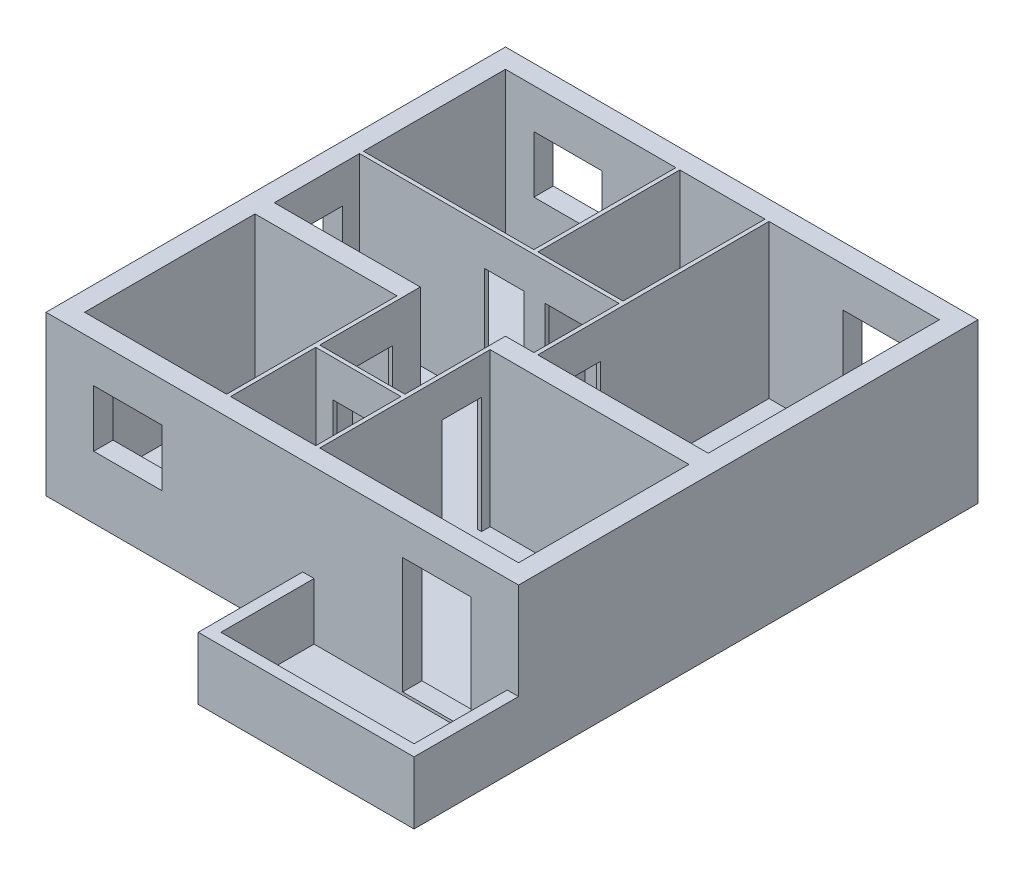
from build123d import *

# Parameters (mm, degrees)
ESQUISSE1_W              = 8320
ESQUISSE1_H              = 8090
ESQUISSE1_W_2            = 2500
ESQUISSE1_H_2            = 3000
ESQUISSE1_W_3            = 1500
ESQUISSE1_H_3            = 1500
ESQUISSE1_W_4            = 3500
ESQUISSE1_W_5            = 3000
ESQUISSE1_H_4            = 4070
ESQUISSE1_H_5            = 2500
BOSS_EXTRU_1_DEPTH       = 2700
BOSS_EXTRU_2_DEPTH       = 100
BOSS_EXTRU_3_DEPTH       = 1000
ESQUISSE4_W              = 900
ESQUISSE4_H              = 2050
ENL_V_MAT_EXTRU_1_DEPTH  = 1000
ESQUISSE5_W              = 700
ESQUISSE5_H              = 2050
ENL_V_MAT_EXTRU_2_DEPTH  = 1000
ESQUISSE6_W              = 700
ESQUISSE6_H              = 2050
ENL_V_MAT_EXTRU_3_DEPTH  = 1921
ESQUISSE7_W              = 700
ESQUISSE7_H              = 2050
ENL_V_MAT_EXTRU_4_DEPTH  = 1921
ESQUISSE8_W              = 700
ESQUISSE8_H              = 2050
ENL_V_MAT_EXTRU_5_DEPTH  = 1412
ESQUISSE9_W              = 700
ESQUISSE9_H              = 2050
ENL_V_MAT_EXTRU_6_DEPTH  = 1412
ESQUISSE10_W             = 1200
ESQUISSE10_H             = 2050
ENL_V_MAT_EXTRU_7_DEPTH  = 668
ESQUISSE11_W             = 1200
ESQUISSE11_H             = 1000
ENL_V_MAT_EXTRU_8_DEPTH  = 668
ESQUISSE12_W             = 1200
ESQUISSE12_H             = 1000
ENL_V_MAT_EXTRU_9_DEPTH  = 668
ESQUISSE13_W             = 1200
ESQUISSE13_H             = 1000
ENL_V_MAT_EXTRU_10_DEPTH = 668


with BuildPart() as part:
    # Esquisse1 → Boss.-Extru.1 (new body)
    with BuildSketch(Plane.XZ):
        with Locations((1320, -705)):
            Rectangle(ESQUISSE1_W, ESQUISSE1_H)
        Polygon((-2500, -340), (-2500, -1840), (2070, -1840), (2070, -340), (1570, -340), (1570, 1430), (70, 1430), (70, -340), align=None, mode=Mode.SUBTRACT)
        with Locations((-1250, 1500)):
            Rectangle(ESQUISSE1_W_2, ESQUISSE1_H_2, mode=Mode.SUBTRACT)
        with Locations((820, 2250)):
            Rectangle(ESQUISSE1_W_3, ESQUISSE1_H_3, mode=Mode.SUBTRACT)
        with Locations((3390, 1500)):
            Rectangle(ESQUISSE1_W_4, ESQUISSE1_H_2, mode=Mode.SUBTRACT)
        with Locations((3640, -2375)):
            Rectangle(ESQUISSE1_W_5, ESQUISSE1_H_4, mode=Mode.SUBTRACT)
        with Locations((1320, -3160)):
            Rectangle(ESQUISSE1_W_3, ESQUISSE1_H_5, mode=Mode.SUBTRACT)
        with Locations((-1000, -3160)):
            Rectangle(ESQUISSE1_W_5, ESQUISSE1_H_5, mode=Mode.SUBTRACT)
    extrude(amount=BOSS_EXTRU_1_DEPTH)

    # Esquisse2 → Boss.-Extru.2 (add)
    with BuildSketch(Plane.XZ.offset(2700)):
        Polygon((5480, -4750), (-2840, -4750), (-2840, 3340), (1680, 3340), (1680, 5180), (5480, 5180), (5480, 3340), align=None)
    extrude(amount=BOSS_EXTRU_2_DEPTH)

    # Esquisse3 → Boss.-Extru.3 (add)
    with BuildSketch(Plane(origin=(0, -2700, 0), x_dir=(1, 0, 0), z_dir=(0, 1, 0))):
        Polygon((5480, -5180), (5048.043845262, -5180), (1680, -5180), (1680, -3340), (1880, -3340), (1880, -4980), (5280, -4980), (5280, -3340), (5480, -3340), align=None)
    extrude(amount=BOSS_EXTRU_3_DEPTH)

    # Esquisse4 → Enl_v. mat.-Extru.1 (cut)
    with BuildSketch(Plane(origin=(-2500, 0, 0), x_dir=(0, 0, -1), z_dir=(1, 0, 0))):
        with Locations((1090, -1675)):
            Rectangle(ESQUISSE4_W, ESQUISSE4_H)
    extrude(amount=-ENL_V_MAT_EXTRU_1_DEPTH, mode=Mode.SUBTRACT)

    # Esquisse5 → Enl_v. mat.-Extru.2 (cut)
    with BuildSketch(Plane(origin=(0, 0, 1430), x_dir=(-1, 0, 0), z_dir=(0, 0, -1))):
        with Locations((-720, -1675)):
            Rectangle(ESQUISSE5_W, ESQUISSE5_H)
    extrude(amount=-ENL_V_MAT_EXTRU_2_DEPTH, mode=Mode.SUBTRACT)

    # Esquisse6 → Enl_v. mat.-Extru.3 (cut)
    with BuildSketch(Plane(origin=(1640, 0, 0), x_dir=(0, 0, -1), z_dir=(1, 0, 0))):
        with Locations((-500, -1675)):
            Rectangle(ESQUISSE6_W, ESQUISSE6_H)
    extrude(amount=-ENL_V_MAT_EXTRU_3_DEPTH, mode=Mode.SUBTRACT)

    # Esquisse7 → Enl_v. mat.-Extru.4 (cut)
    with BuildSketch(Plane.ZY.offset(-2070)):
        with Locations((-1090, -1675)):
            Rectangle(ESQUISSE7_W, ESQUISSE7_H)
    extrude(amount=-ENL_V_MAT_EXTRU_4_DEPTH, mode=Mode.SUBTRACT)

    # Esquisse8 → Enl_v. mat.-Extru.5 (cut)
    with BuildSketch(Plane(origin=(0, 0, -1910), x_dir=(-1, 0, 0), z_dir=(0, 0, -1))):
        with Locations((-1120, -1675)):
            Rectangle(ESQUISSE8_W, ESQUISSE8_H)
    extrude(amount=-ENL_V_MAT_EXTRU_5_DEPTH, mode=Mode.SUBTRACT)

    # Esquisse9 → Enl_v. mat.-Extru.6 (cut)
    with BuildSketch(Plane(origin=(0, 0, -1910), x_dir=(-1, 0, 0), z_dir=(0, 0, -1))):
        with Locations((-50, -1675)):
            Rectangle(ESQUISSE9_W, ESQUISSE9_H)
    extrude(amount=-ENL_V_MAT_EXTRU_6_DEPTH, mode=Mode.SUBTRACT)

    # Esquisse10 → Enl_v. mat.-Extru.7 (cut)
    with BuildSketch(Plane(origin=(0, 0, 3000), x_dir=(-1, 0, 0), z_dir=(0, 0, -1))):
        with Locations((-4040, -1625)):
            Rectangle(ESQUISSE10_W, ESQUISSE10_H)
    extrude(amount=-ENL_V_MAT_EXTRU_7_DEPTH, mode=Mode.SUBTRACT)

    # Esquisse11 → Enl_v. mat.-Extru.8 (cut)
    with BuildSketch(Plane.XY.offset(-4410)):
        with Locations((4040, -1200)):
            Rectangle(ESQUISSE11_W, ESQUISSE11_H)
    extrude(amount=-ENL_V_MAT_EXTRU_8_DEPTH, mode=Mode.SUBTRACT)

    # Esquisse12 → Enl_v. mat.-Extru.9 (cut)
    with BuildSketch(Plane(origin=(0, 0, 3000), x_dir=(-1, 0, 0), z_dir=(0, 0, -1))):
        with Locations((1400, -1200)):
            Rectangle(ESQUISSE12_W, ESQUISSE12_H)
    extrude(amount=-ENL_V_MAT_EXTRU_9_DEPTH, mode=Mode.SUBTRACT)

    # Esquisse13 → Enl_v. mat.-Extru.10 (cut)
    with BuildSketch(Plane.XY.offset(-4410)):
        with Locations((-1400, -1200)):
            Rectangle(ESQUISSE13_W, ESQUISSE13_H)
    extrude(amount=-ENL_V_MAT_EXTRU_10_DEPTH, mode=Mode.SUBTRACT)


solid = part.part
